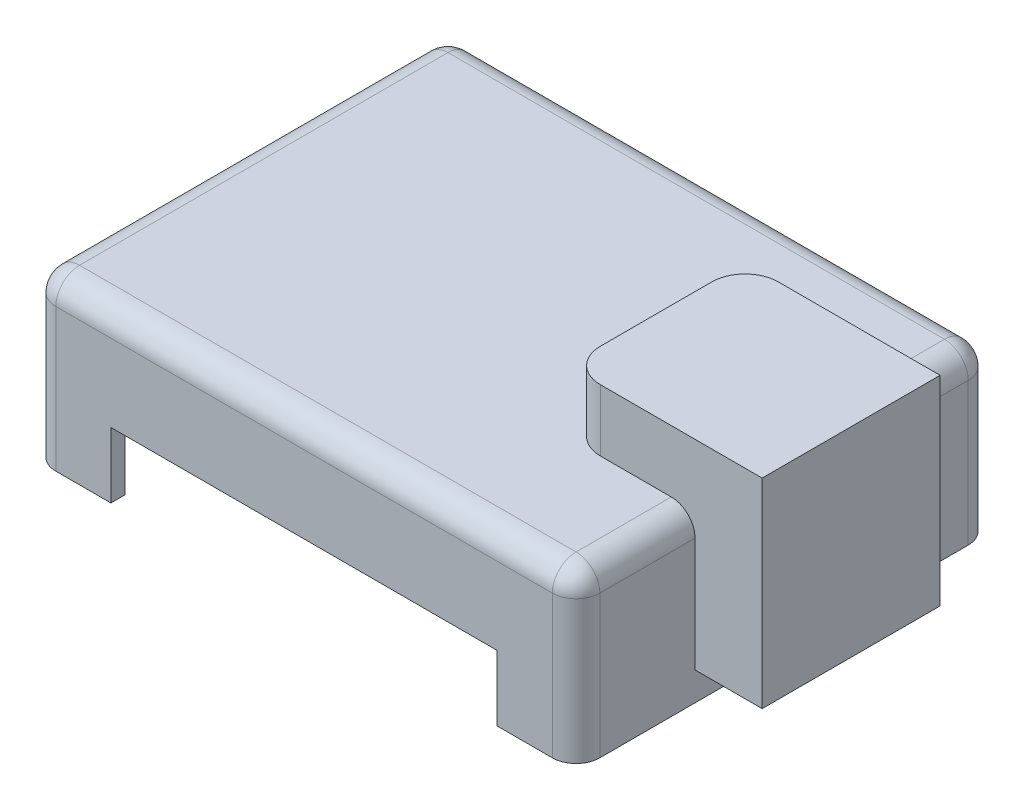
ISO-10303-21;
HEADER;
FILE_DESCRIPTION(('STEP AP214'),'2;1');
FILE_NAME('part.step','',(''),(''),'','','');
FILE_SCHEMA(('AUTOMOTIVE_DESIGN { 1 0 10303 214 1 1 1 1 }'));
ENDSEC;
DATA;
#1=APPLICATION_CONTEXT('core data for automotive mechanical design processes');
#2=APPLICATION_PROTOCOL_DEFINITION('international standard','automotive_design',2000,#1);
#3=PRODUCT_CONTEXT('',#1,'mechanical');
#4=PRODUCT('Part','Part','',(#3));
#5=PRODUCT_RELATED_PRODUCT_CATEGORY('part','',(#4));
#6=PRODUCT_DEFINITION_FORMATION('','',#4);
#7=PRODUCT_DEFINITION_CONTEXT('part definition',#1,'design');
#8=PRODUCT_DEFINITION('design','',#6,#7);
#9=PRODUCT_DEFINITION_SHAPE('','',#8);
#10=(LENGTH_UNIT() NAMED_UNIT(*) SI_UNIT(.MILLI.,.METRE.));
#11=(NAMED_UNIT(*) PLANE_ANGLE_UNIT() SI_UNIT($,.RADIAN.));
#12=(NAMED_UNIT(*) SI_UNIT($,.STERADIAN.) SOLID_ANGLE_UNIT());
#13=UNCERTAINTY_MEASURE_WITH_UNIT(LENGTH_MEASURE(1.E-05),#10,'distance_accuracy_value','');
#14=(GEOMETRIC_REPRESENTATION_CONTEXT(3) GLOBAL_UNCERTAINTY_ASSIGNED_CONTEXT((#13)) GLOBAL_UNIT_ASSIGNED_CONTEXT((#10,
#11,#12)) REPRESENTATION_CONTEXT('',''));
#15=CARTESIAN_POINT('',(0.,0.,0.));
#16=DIRECTION('',(0.,0.,1.));
#17=DIRECTION('',(1.,0.,0.));
#18=AXIS2_PLACEMENT_3D('',#15,#16,#17);
#19=CARTESIAN_POINT('',(71.3184047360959,48.,-18.7130463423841));
#20=DIRECTION('',(-1.,0.,0.));
#21=DIRECTION('',(0.,0.,1.));
#22=AXIS2_PLACEMENT_3D('',#19,#20,#21);
#23=PLANE('',#22);
#24=DIRECTION('',(0.,-1.,0.));
#25=VECTOR('',#24,1.);
#26=CARTESIAN_POINT('',(71.3184047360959,48.,18.7130463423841));
#27=LINE('',#26,#25);
#28=CARTESIAN_POINT('',(71.3184047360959,48.,18.7130463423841));
#29=VERTEX_POINT('',#28);
#30=CARTESIAN_POINT('',(71.3184047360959,6.00000000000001,18.7130463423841));
#31=VERTEX_POINT('',#30);
#32=EDGE_CURVE('E106',#29,#31,#27,.T.);
#33=ORIENTED_EDGE('',*,*,#32,.T.);
#34=DIRECTION('',(0.,0.,-1.));
#35=VECTOR('',#34,1.);
#36=CARTESIAN_POINT('',(71.3184047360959,6.00000000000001,-18.7130463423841));
#37=LINE('',#36,#35);
#38=CARTESIAN_POINT('',(71.3184047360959,6.00000000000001,-18.7130463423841));
#39=VERTEX_POINT('',#38);
#40=EDGE_CURVE('E100',#31,#39,#37,.T.);
#41=ORIENTED_EDGE('',*,*,#40,.T.);
#42=DIRECTION('',(0.,-1.,0.));
#43=VECTOR('',#42,1.);
#44=CARTESIAN_POINT('',(71.3184047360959,48.,-18.7130463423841));
#45=LINE('',#44,#43);
#46=CARTESIAN_POINT('',(71.3184047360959,48.,-18.7130463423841));
#47=VERTEX_POINT('',#46);
#48=EDGE_CURVE('E12',#47,#39,#45,.T.);
#49=ORIENTED_EDGE('',*,*,#48,.F.);
#50=DIRECTION('',(0.,0.,-1.));
#51=VECTOR('',#50,1.);
#52=CARTESIAN_POINT('',(71.3184047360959,48.,-18.7130463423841));
#53=LINE('',#52,#51);
#54=EDGE_CURVE('E118',#29,#47,#53,.T.);
#55=ORIENTED_EDGE('',*,*,#54,.F.);
#56=EDGE_LOOP('',(#33,#41,#49,#55));
#57=FACE_BOUND('',#56,.T.);
#58=ADVANCED_FACE('F36',(#57),#23,.F.);
#59=CARTESIAN_POINT('',(37.3006394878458,48.,-18.7130463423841));
#60=DIRECTION('',(0.,0.,1.));
#61=DIRECTION('',(1.,0.,0.));
#62=AXIS2_PLACEMENT_3D('',#59,#60,#61);
#63=PLANE('',#62);
#64=ORIENTED_EDGE('',*,*,#48,.T.);
#65=DIRECTION('',(-1.,0.,0.));
#66=VECTOR('',#65,1.);
#67=CARTESIAN_POINT('',(37.3006394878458,6.00000000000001,-18.7130463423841));
#68=LINE('',#67,#66);
#69=CARTESIAN_POINT('',(37.3006394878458,6.00000000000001,-18.7130463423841));
#70=VERTEX_POINT('',#69);
#71=EDGE_CURVE('E90',#39,#70,#68,.T.);
#72=ORIENTED_EDGE('',*,*,#71,.T.);
#73=DIRECTION('',(0.,-1.,0.));
#74=VECTOR('',#73,1.);
#75=CARTESIAN_POINT('',(37.3006394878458,48.,-18.7130463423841));
#76=LINE('',#75,#74);
#77=CARTESIAN_POINT('',(37.3006394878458,48.,-18.7130463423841));
#78=VERTEX_POINT('',#77);
#79=EDGE_CURVE('E43',#78,#70,#76,.T.);
#80=ORIENTED_EDGE('',*,*,#79,.F.);
#81=DIRECTION('',(-1.,0.,0.));
#82=VECTOR('',#81,1.);
#83=CARTESIAN_POINT('',(37.3006394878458,48.,-18.7130463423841));
#84=LINE('',#83,#82);
#85=EDGE_CURVE('E91',#47,#78,#84,.T.);
#86=ORIENTED_EDGE('',*,*,#85,.F.);
#87=EDGE_LOOP('',(#64,#72,#80,#86));
#88=FACE_BOUND('',#87,.T.);
#89=ADVANCED_FACE('F88',(#88),#63,.F.);
#90=CARTESIAN_POINT('',(37.3006394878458,48.,-11.7130463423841));
#91=DIRECTION('',(0.,-1.,0.));
#92=DIRECTION('',(0.,0.,-1.));
#93=AXIS2_PLACEMENT_3D('',#90,#91,#92);
#94=CYLINDRICAL_SURFACE('',#93,7.);
#95=ORIENTED_EDGE('',*,*,#79,.T.);
#96=CARTESIAN_POINT('',(37.3006394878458,6.00000000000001,-11.7130463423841));
#97=DIRECTION('',(0.,1.,0.));
#98=DIRECTION('',(0.,0.,1.));
#99=AXIS2_PLACEMENT_3D('',#96,#97,#98);
#100=CIRCLE('',#99,7.);
#101=CARTESIAN_POINT('',(30.3006394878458,6.00000000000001,-11.7130463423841));
#102=VERTEX_POINT('',#101);
#103=EDGE_CURVE('E104',#70,#102,#100,.T.);
#104=ORIENTED_EDGE('',*,*,#103,.T.);
#105=DIRECTION('',(0.,-1.,0.));
#106=VECTOR('',#105,1.);
#107=CARTESIAN_POINT('',(30.3006394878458,48.,-11.7130463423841));
#108=LINE('',#107,#106);
#109=CARTESIAN_POINT('',(30.3006394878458,48.,-11.7130463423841));
#110=VERTEX_POINT('',#109);
#111=EDGE_CURVE('E132',#110,#102,#108,.T.);
#112=ORIENTED_EDGE('',*,*,#111,.F.);
#113=CARTESIAN_POINT('',(37.3006394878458,48.,-11.7130463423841));
#114=DIRECTION('',(0.,1.,0.));
#115=DIRECTION('',(0.,0.,1.));
#116=AXIS2_PLACEMENT_3D('',#113,#114,#115);
#117=CIRCLE('',#116,7.);
#118=EDGE_CURVE('E121',#78,#110,#117,.T.);
#119=ORIENTED_EDGE('',*,*,#118,.F.);
#120=EDGE_LOOP('',(#95,#104,#112,#119));
#121=FACE_BOUND('',#120,.T.);
#122=ADVANCED_FACE('F135',(#121),#94,.T.);
#123=CARTESIAN_POINT('',(30.3006394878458,48.,-11.7130463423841));
#124=DIRECTION('',(1.,0.,0.));
#125=DIRECTION('',(0.,0.,-1.));
#126=AXIS2_PLACEMENT_3D('',#123,#124,#125);
#127=PLANE('',#126);
#128=ORIENTED_EDGE('',*,*,#111,.T.);
#129=DIRECTION('',(0.,0.,1.));
#130=VECTOR('',#129,1.);
#131=CARTESIAN_POINT('',(30.3006394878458,6.00000000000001,-11.7130463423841));
#132=LINE('',#131,#130);
#133=CARTESIAN_POINT('',(30.3006394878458,6.00000000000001,11.7130463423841));
#134=VERTEX_POINT('',#133);
#135=EDGE_CURVE('E110',#102,#134,#132,.T.);
#136=ORIENTED_EDGE('',*,*,#135,.T.);
#137=DIRECTION('',(0.,-1.,0.));
#138=VECTOR('',#137,1.);
#139=CARTESIAN_POINT('',(30.3006394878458,48.,11.7130463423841));
#140=LINE('',#139,#138);
#141=CARTESIAN_POINT('',(30.3006394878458,48.,11.7130463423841));
#142=VERTEX_POINT('',#141);
#143=EDGE_CURVE('E130',#142,#134,#140,.T.);
#144=ORIENTED_EDGE('',*,*,#143,.F.);
#145=DIRECTION('',(0.,0.,1.));
#146=VECTOR('',#145,1.);
#147=CARTESIAN_POINT('',(30.3006394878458,48.,-11.7130463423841));
#148=LINE('',#147,#146);
#149=EDGE_CURVE('E123',#110,#142,#148,.T.);
#150=ORIENTED_EDGE('',*,*,#149,.F.);
#151=EDGE_LOOP('',(#128,#136,#144,#150));
#152=FACE_BOUND('',#151,.T.);
#153=ADVANCED_FACE('F141',(#152),#127,.F.);
#154=CARTESIAN_POINT('',(37.3006394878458,48.,11.7130463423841));
#155=DIRECTION('',(0.,-1.,0.));
#156=DIRECTION('',(0.,0.,-1.));
#157=AXIS2_PLACEMENT_3D('',#154,#155,#156);
#158=CYLINDRICAL_SURFACE('',#157,7.);
#159=ORIENTED_EDGE('',*,*,#143,.T.);
#160=CARTESIAN_POINT('',(37.3006394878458,6.00000000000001,11.7130463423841));
#161=DIRECTION('',(0.,1.,0.));
#162=DIRECTION('',(0.,0.,1.));
#163=AXIS2_PLACEMENT_3D('',#160,#161,#162);
#164=CIRCLE('',#163,7.);
#165=CARTESIAN_POINT('',(37.3006394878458,6.00000000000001,18.7130463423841));
#166=VERTEX_POINT('',#165);
#167=EDGE_CURVE('E113',#134,#166,#164,.T.);
#168=ORIENTED_EDGE('',*,*,#167,.T.);
#169=DIRECTION('',(0.,-1.,0.));
#170=VECTOR('',#169,1.);
#171=CARTESIAN_POINT('',(37.3006394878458,48.,18.7130463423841));
#172=LINE('',#171,#170);
#173=CARTESIAN_POINT('',(37.3006394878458,48.,18.7130463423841));
#174=VERTEX_POINT('',#173);
#175=EDGE_CURVE('E128',#174,#166,#172,.T.);
#176=ORIENTED_EDGE('',*,*,#175,.F.);
#177=CARTESIAN_POINT('',(37.3006394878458,48.,11.7130463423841));
#178=DIRECTION('',(0.,1.,0.));
#179=DIRECTION('',(0.,0.,1.));
#180=AXIS2_PLACEMENT_3D('',#177,#178,#179);
#181=CIRCLE('',#180,7.);
#182=EDGE_CURVE('E55',#142,#174,#181,.T.);
#183=ORIENTED_EDGE('',*,*,#182,.F.);
#184=EDGE_LOOP('',(#159,#168,#176,#183));
#185=FACE_BOUND('',#184,.T.);
#186=ADVANCED_FACE('F144',(#185),#158,.T.);
#187=CARTESIAN_POINT('',(37.3006394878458,48.,18.7130463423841));
#188=DIRECTION('',(0.,0.,-1.));
#189=DIRECTION('',(-1.,0.,0.));
#190=AXIS2_PLACEMENT_3D('',#187,#188,#189);
#191=PLANE('',#190);
#192=ORIENTED_EDGE('',*,*,#175,.T.);
#193=DIRECTION('',(1.,0.,0.));
#194=VECTOR('',#193,1.);
#195=CARTESIAN_POINT('',(37.3006394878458,6.00000000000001,18.7130463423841));
#196=LINE('',#195,#194);
#197=EDGE_CURVE('E116',#166,#31,#196,.T.);
#198=ORIENTED_EDGE('',*,*,#197,.T.);
#199=ORIENTED_EDGE('',*,*,#32,.F.);
#200=DIRECTION('',(1.,0.,0.));
#201=VECTOR('',#200,1.);
#202=CARTESIAN_POINT('',(37.3006394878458,48.,18.7130463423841));
#203=LINE('',#202,#201);
#204=EDGE_CURVE('E50',#174,#29,#203,.T.);
#205=ORIENTED_EDGE('',*,*,#204,.F.);
#206=EDGE_LOOP('',(#192,#198,#199,#205));
#207=FACE_BOUND('',#206,.T.);
#208=ADVANCED_FACE('F146',(#207),#191,.F.);
#209=CARTESIAN_POINT('',(37.3006394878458,48.,11.7130463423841));
#210=DIRECTION('',(0.,1.,0.));
#211=DIRECTION('',(0.,0.,1.));
#212=AXIS2_PLACEMENT_3D('',#209,#210,#211);
#213=PLANE('',#212);
#214=ORIENTED_EDGE('',*,*,#54,.T.);
#215=ORIENTED_EDGE('',*,*,#85,.T.);
#216=ORIENTED_EDGE('',*,*,#118,.T.);
#217=ORIENTED_EDGE('',*,*,#149,.T.);
#218=ORIENTED_EDGE('',*,*,#182,.T.);
#219=ORIENTED_EDGE('',*,*,#204,.T.);
#220=EDGE_LOOP('',(#214,#215,#216,#217,#218,#219));
#221=FACE_BOUND('',#220,.T.);
#222=ADVANCED_FACE('F138',(#221),#213,.T.);
#223=CARTESIAN_POINT('',(37.3006394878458,6.00000000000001,11.7130463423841));
#224=DIRECTION('',(0.,1.,0.));
#225=DIRECTION('',(0.,0.,1.));
#226=AXIS2_PLACEMENT_3D('',#223,#224,#225);
#227=PLANE('',#226);
#228=ORIENTED_EDGE('',*,*,#40,.F.);
#229=ORIENTED_EDGE('',*,*,#197,.F.);
#230=ORIENTED_EDGE('',*,*,#167,.F.);
#231=ORIENTED_EDGE('',*,*,#135,.F.);
#232=ORIENTED_EDGE('',*,*,#103,.F.);
#233=ORIENTED_EDGE('',*,*,#71,.F.);
#234=EDGE_LOOP('',(#228,#229,#230,#231,#232,#233));
#235=FACE_BOUND('',#234,.T.);
#236=ADVANCED_FACE('F98',(#235),#227,.F.);
#237=CLOSED_SHELL('',(#58,#89,#122,#153,#186,#208,#222,#236));
#238=MANIFOLD_SOLID_BREP('B2',#237);
#239=CARTESIAN_POINT('',(-57.2074120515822,35.,-43.7327831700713));
#240=DIRECTION('',(1.,0.,0.));
#241=DIRECTION('',(0.,0.,-1.));
#242=AXIS2_PLACEMENT_3D('',#239,#240,#241);
#243=PLANE('',#242);
#244=DIRECTION('',(0.,0.,1.));
#245=VECTOR('',#244,1.);
#246=CARTESIAN_POINT('',(-57.2074120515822,30.,-43.7327831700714));
#247=LINE('',#246,#245);
#248=CARTESIAN_POINT('',(-57.2074120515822,30.,38.7327831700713));
#249=VERTEX_POINT('',#248);
#250=CARTESIAN_POINT('',(-57.2074120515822,30.,-38.7327831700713));
#251=VERTEX_POINT('',#250);
#252=EDGE_CURVE('E468',#249,#251,#247,.F.);
#253=ORIENTED_EDGE('',*,*,#252,.T.);
#254=DIRECTION('',(0.,-1.,0.));
#255=VECTOR('',#254,1.);
#256=CARTESIAN_POINT('',(-57.2074120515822,35.,-38.7327831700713));
#257=LINE('',#256,#255);
#258=CARTESIAN_POINT('',(-57.2074120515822,0.,-38.7327831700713));
#259=VERTEX_POINT('',#258);
#260=EDGE_CURVE('E470',#251,#259,#257,.T.);
#261=ORIENTED_EDGE('',*,*,#260,.T.);
#262=DIRECTION('',(0.,0.,1.));
#263=VECTOR('',#262,1.);
#264=CARTESIAN_POINT('',(-57.2074120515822,0.,-43.7327831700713));
#265=LINE('',#264,#263);
#266=CARTESIAN_POINT('',(-57.2074120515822,0.,38.7327831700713));
#267=VERTEX_POINT('',#266);
#268=EDGE_CURVE('E426',#259,#267,#265,.T.);
#269=ORIENTED_EDGE('',*,*,#268,.T.);
#270=DIRECTION('',(0.,-1.,0.));
#271=VECTOR('',#270,1.);
#272=CARTESIAN_POINT('',(-57.2074120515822,35.,38.7327831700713));
#273=LINE('',#272,#271);
#274=EDGE_CURVE('E466',#267,#249,#273,.F.);
#275=ORIENTED_EDGE('',*,*,#274,.T.);
#276=EDGE_LOOP('',(#253,#261,#269,#275));
#277=FACE_BOUND('',#276,.T.);
#278=ADVANCED_FACE('F196',(#277),#243,.F.);
#279=CARTESIAN_POINT('',(-57.2074120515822,35.,43.7327831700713));
#280=DIRECTION('',(0.,0.,-1.));
#281=DIRECTION('',(-1.,0.,0.));
#282=AXIS2_PLACEMENT_3D('',#279,#280,#281);
#283=PLANE('',#282);
#284=DIRECTION('',(1.,0.,0.));
#285=VECTOR('',#284,1.);
#286=CARTESIAN_POINT('',(-57.2074120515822,0.,43.7327831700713));
#287=LINE('',#286,#285);
#288=CARTESIAN_POINT('',(-52.2074120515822,0.,43.7327831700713));
#289=VERTEX_POINT('',#288);
#290=CARTESIAN_POINT('',(-40.6196419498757,0.,43.7327831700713));
#291=VERTEX_POINT('',#290);
#292=EDGE_CURVE('E429',#289,#291,#287,.T.);
#293=ORIENTED_EDGE('',*,*,#292,.T.);
#294=DIRECTION('',(0.,-1.,0.));
#295=VECTOR('',#294,1.);
#296=CARTESIAN_POINT('',(-40.6196419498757,0.,43.7327831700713));
#297=LINE('',#296,#295);
#298=CARTESIAN_POINT('',(-40.6196419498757,13.7609534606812,43.7327831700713));
#299=VERTEX_POINT('',#298);
#300=EDGE_CURVE('E372',#299,#291,#297,.T.);
#301=ORIENTED_EDGE('',*,*,#300,.F.);
#302=DIRECTION('',(-1.,0.,0.));
#303=VECTOR('',#302,1.);
#304=CARTESIAN_POINT('',(-40.6196419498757,13.7609534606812,43.7327831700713));
#305=LINE('',#304,#303);
#306=CARTESIAN_POINT('',(40.6196419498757,13.7609534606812,43.7327831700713));
#307=VERTEX_POINT('',#306);
#308=EDGE_CURVE('E858',#307,#299,#305,.T.);
#309=ORIENTED_EDGE('',*,*,#308,.F.);
#310=DIRECTION('',(0.,1.,0.));
#311=VECTOR('',#310,1.);
#312=CARTESIAN_POINT('',(40.6196419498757,0.,43.7327831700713));
#313=LINE('',#312,#311);
#314=CARTESIAN_POINT('',(40.6196419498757,0.,43.7327831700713));
#315=VERTEX_POINT('',#314);
#316=EDGE_CURVE('E913',#315,#307,#313,.T.);
#317=ORIENTED_EDGE('',*,*,#316,.F.);
#318=CARTESIAN_POINT('',(52.2074120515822,0.,43.7327831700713));
#319=VERTEX_POINT('',#318);
#320=EDGE_CURVE('E371',#315,#319,#287,.T.);
#321=ORIENTED_EDGE('',*,*,#320,.T.);
#322=DIRECTION('',(0.,-1.,0.));
#323=VECTOR('',#322,1.);
#324=CARTESIAN_POINT('',(52.2074120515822,35.,43.7327831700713));
#325=LINE('',#324,#323);
#326=CARTESIAN_POINT('',(52.2074120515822,30.,43.7327831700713));
#327=VERTEX_POINT('',#326);
#328=EDGE_CURVE('E464',#319,#327,#325,.F.);
#329=ORIENTED_EDGE('',*,*,#328,.T.);
#330=DIRECTION('',(1.,0.,0.));
#331=VECTOR('',#330,1.);
#332=CARTESIAN_POINT('',(-57.2074120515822,30.,43.7327831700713));
#333=LINE('',#332,#331);
#334=CARTESIAN_POINT('',(-52.2074120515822,30.,43.7327831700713));
#335=VERTEX_POINT('',#334);
#336=EDGE_CURVE('E462',#327,#335,#333,.F.);
#337=ORIENTED_EDGE('',*,*,#336,.T.);
#338=DIRECTION('',(0.,-1.,0.));
#339=VECTOR('',#338,1.);
#340=CARTESIAN_POINT('',(-52.2074120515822,35.,43.7327831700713));
#341=LINE('',#340,#339);
#342=EDGE_CURVE('E460',#335,#289,#341,.T.);
#343=ORIENTED_EDGE('',*,*,#342,.T.);
#344=EDGE_LOOP('',(#293,#301,#309,#317,#321,#329,#337,#343));
#345=FACE_BOUND('',#344,.T.);
#346=ADVANCED_FACE('F511',(#345),#283,.F.);
#347=CARTESIAN_POINT('',(57.2074120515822,35.,-43.7327831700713));
#348=DIRECTION('',(-1.,0.,0.));
#349=DIRECTION('',(0.,0.,1.));
#350=AXIS2_PLACEMENT_3D('',#347,#348,#349);
#351=PLANE('',#350);
#352=DIRECTION('',(0.,0.,-1.));
#353=VECTOR('',#352,1.);
#354=CARTESIAN_POINT('',(57.2074120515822,0.,-43.7327831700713));
#355=LINE('',#354,#353);
#356=CARTESIAN_POINT('',(57.2074120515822,0.,38.7327831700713));
#357=VERTEX_POINT('',#356);
#358=CARTESIAN_POINT('',(57.2074120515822,0.,-38.7327831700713));
#359=VERTEX_POINT('',#358);
#360=EDGE_CURVE('E432',#357,#359,#355,.T.);
#361=ORIENTED_EDGE('',*,*,#360,.T.);
#362=DIRECTION('',(0.,-1.,0.));
#363=VECTOR('',#362,1.);
#364=CARTESIAN_POINT('',(57.2074120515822,35.,-38.7327831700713));
#365=LINE('',#364,#363);
#366=CARTESIAN_POINT('',(57.2074120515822,30.,-38.7327831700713));
#367=VERTEX_POINT('',#366);
#368=EDGE_CURVE('E458',#359,#367,#365,.F.);
#369=ORIENTED_EDGE('',*,*,#368,.T.);
#370=DIRECTION('',(0.,0.,-1.));
#371=VECTOR('',#370,1.);
#372=CARTESIAN_POINT('',(57.2074120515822,30.,43.7327831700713));
#373=LINE('',#372,#371);
#374=CARTESIAN_POINT('',(57.2074120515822,30.,38.7327831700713));
#375=VERTEX_POINT('',#374);
#376=EDGE_CURVE('E456',#367,#375,#373,.F.);
#377=ORIENTED_EDGE('',*,*,#376,.T.);
#378=DIRECTION('',(0.,-1.,0.));
#379=VECTOR('',#378,1.);
#380=CARTESIAN_POINT('',(57.2074120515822,35.,38.7327831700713));
#381=LINE('',#380,#379);
#382=EDGE_CURVE('E454',#375,#357,#381,.T.);
#383=ORIENTED_EDGE('',*,*,#382,.T.);
#384=EDGE_LOOP('',(#361,#369,#377,#383));
#385=FACE_BOUND('',#384,.T.);
#386=ADVANCED_FACE('F483',(#385),#351,.F.);
#387=CARTESIAN_POINT('',(-57.2074120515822,35.,-43.7327831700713));
#388=DIRECTION('',(0.,0.,1.));
#389=DIRECTION('',(1.,0.,0.));
#390=AXIS2_PLACEMENT_3D('',#387,#388,#389);
#391=PLANE('',#390);
#392=DIRECTION('',(-1.,0.,0.));
#393=VECTOR('',#392,1.);
#394=CARTESIAN_POINT('',(-57.2074120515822,0.,-43.7327831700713));
#395=LINE('',#394,#393);
#396=CARTESIAN_POINT('',(52.2074120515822,0.,-43.7327831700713));
#397=VERTEX_POINT('',#396);
#398=CARTESIAN_POINT('',(-52.2074120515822,0.,-43.7327831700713));
#399=VERTEX_POINT('',#398);
#400=EDGE_CURVE('E435',#397,#399,#395,.T.);
#401=ORIENTED_EDGE('',*,*,#400,.T.);
#402=DIRECTION('',(0.,-1.,0.));
#403=VECTOR('',#402,1.);
#404=CARTESIAN_POINT('',(-52.2074120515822,35.,-43.7327831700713));
#405=LINE('',#404,#403);
#406=CARTESIAN_POINT('',(-52.2074120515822,30.,-43.7327831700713));
#407=VERTEX_POINT('',#406);
#408=EDGE_CURVE('E452',#399,#407,#405,.F.);
#409=ORIENTED_EDGE('',*,*,#408,.T.);
#410=DIRECTION('',(-1.,0.,0.));
#411=VECTOR('',#410,1.);
#412=CARTESIAN_POINT('',(57.2074120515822,30.,-43.7327831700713));
#413=LINE('',#412,#411);
#414=CARTESIAN_POINT('',(52.2074120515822,30.,-43.7327831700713));
#415=VERTEX_POINT('',#414);
#416=EDGE_CURVE('E449',#407,#415,#413,.F.);
#417=ORIENTED_EDGE('',*,*,#416,.T.);
#418=DIRECTION('',(0.,-1.,0.));
#419=VECTOR('',#418,1.);
#420=CARTESIAN_POINT('',(52.2074120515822,35.,-43.7327831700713));
#421=LINE('',#420,#419);
#422=EDGE_CURVE('E447',#415,#397,#421,.T.);
#423=ORIENTED_EDGE('',*,*,#422,.T.);
#424=EDGE_LOOP('',(#401,#409,#417,#423));
#425=FACE_BOUND('',#424,.T.);
#426=ADVANCED_FACE('F540',(#425),#391,.F.);
#427=CARTESIAN_POINT('',(-57.2074120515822,35.,43.7327831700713));
#428=DIRECTION('',(0.,1.,0.));
#429=DIRECTION('',(0.,0.,1.));
#430=AXIS2_PLACEMENT_3D('',#427,#428,#429);
#431=PLANE('',#430);
#432=DIRECTION('',(0.,0.,-1.));
#433=VECTOR('',#432,1.);
#434=CARTESIAN_POINT('',(52.2074120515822,35.,-43.7327831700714));
#435=LINE('',#434,#433);
#436=CARTESIAN_POINT('',(52.2074120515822,35.,38.7327831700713));
#437=VERTEX_POINT('',#436);
#438=CARTESIAN_POINT('',(52.2074120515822,35.,-38.7327831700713));
#439=VERTEX_POINT('',#438);
#440=EDGE_CURVE('E442',#437,#439,#435,.T.);
#441=ORIENTED_EDGE('',*,*,#440,.T.);
#442=DIRECTION('',(-1.,0.,0.));
#443=VECTOR('',#442,1.);
#444=CARTESIAN_POINT('',(-57.2074120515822,35.,-38.7327831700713));
#445=LINE('',#444,#443);
#446=CARTESIAN_POINT('',(-52.2074120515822,35.,-38.7327831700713));
#447=VERTEX_POINT('',#446);
#448=EDGE_CURVE('E444',#439,#447,#445,.T.);
#449=ORIENTED_EDGE('',*,*,#448,.T.);
#450=DIRECTION('',(0.,0.,1.));
#451=VECTOR('',#450,1.);
#452=CARTESIAN_POINT('',(-52.2074120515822,35.,43.7327831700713));
#453=LINE('',#452,#451);
#454=CARTESIAN_POINT('',(-52.2074120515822,35.,38.7327831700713));
#455=VERTEX_POINT('',#454);
#456=EDGE_CURVE('E438',#447,#455,#453,.T.);
#457=ORIENTED_EDGE('',*,*,#456,.T.);
#458=DIRECTION('',(1.,0.,0.));
#459=VECTOR('',#458,1.);
#460=CARTESIAN_POINT('',(57.2074120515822,35.,38.7327831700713));
#461=LINE('',#460,#459);
#462=EDGE_CURVE('E440',#455,#437,#461,.T.);
#463=ORIENTED_EDGE('',*,*,#462,.T.);
#464=EDGE_LOOP('',(#441,#449,#457,#463));
#465=FACE_BOUND('',#464,.T.);
#466=ADVANCED_FACE('F542',(#465),#431,.T.);
#467=CARTESIAN_POINT('',(-57.2074120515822,0.,43.7327831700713));
#468=DIRECTION('',(0.,1.,0.));
#469=DIRECTION('',(0.,0.,1.));
#470=AXIS2_PLACEMENT_3D('',#467,#468,#469);
#471=PLANE('',#470);
#472=DIRECTION('',(1.,0.,0.));
#473=VECTOR('',#472,1.);
#474=CARTESIAN_POINT('',(-57.2074120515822,0.,40.7327831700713));
#475=LINE('',#474,#473);
#476=CARTESIAN_POINT('',(-52.2074120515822,0.,40.7327831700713));
#477=VERTEX_POINT('',#476);
#478=CARTESIAN_POINT('',(-40.6196419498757,0.,40.7327831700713));
#479=VERTEX_POINT('',#478);
#480=EDGE_CURVE('E218',#477,#479,#475,.T.);
#481=ORIENTED_EDGE('',*,*,#480,.T.);
#482=DIRECTION('',(0.,0.,1.));
#483=VECTOR('',#482,1.);
#484=CARTESIAN_POINT('',(-40.6196419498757,0.,-43.7337831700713));
#485=LINE('',#484,#483);
#486=EDGE_CURVE('E904',#479,#291,#485,.T.);
#487=ORIENTED_EDGE('',*,*,#486,.T.);
#488=ORIENTED_EDGE('',*,*,#292,.F.);
#489=CARTESIAN_POINT('',(-52.2074120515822,0.,38.7327831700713));
#490=DIRECTION('',(0.,1.,0.));
#491=DIRECTION('',(0.,0.,1.));
#492=AXIS2_PLACEMENT_3D('',#489,#490,#491);
#493=CIRCLE('',#492,5.);
#494=EDGE_CURVE('E472',#289,#267,#493,.F.);
#495=ORIENTED_EDGE('',*,*,#494,.T.);
#496=ORIENTED_EDGE('',*,*,#268,.F.);
#497=CARTESIAN_POINT('',(-52.2074120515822,0.,-38.7327831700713));
#498=DIRECTION('',(0.,1.,0.));
#499=DIRECTION('',(0.,0.,1.));
#500=AXIS2_PLACEMENT_3D('',#497,#498,#499);
#501=CIRCLE('',#500,5.);
#502=EDGE_CURVE('E34',#259,#399,#501,.F.);
#503=ORIENTED_EDGE('',*,*,#502,.T.);
#504=ORIENTED_EDGE('',*,*,#400,.F.);
#505=CARTESIAN_POINT('',(52.2074120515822,0.,-38.7327831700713));
#506=DIRECTION('',(0.,1.,0.));
#507=DIRECTION('',(0.,0.,1.));
#508=AXIS2_PLACEMENT_3D('',#505,#506,#507);
#509=CIRCLE('',#508,5.);
#510=EDGE_CURVE('E203',#397,#359,#509,.F.);
#511=ORIENTED_EDGE('',*,*,#510,.T.);
#512=ORIENTED_EDGE('',*,*,#360,.F.);
#513=CARTESIAN_POINT('',(52.2074120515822,0.,38.7327831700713));
#514=DIRECTION('',(0.,1.,0.));
#515=DIRECTION('',(0.,0.,1.));
#516=AXIS2_PLACEMENT_3D('',#513,#514,#515);
#517=CIRCLE('',#516,5.);
#518=EDGE_CURVE('E474',#357,#319,#517,.F.);
#519=ORIENTED_EDGE('',*,*,#518,.T.);
#520=ORIENTED_EDGE('',*,*,#320,.F.);
#521=DIRECTION('',(0.,0.,1.));
#522=VECTOR('',#521,1.);
#523=CARTESIAN_POINT('',(40.6196419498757,0.,-43.7337831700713));
#524=LINE('',#523,#522);
#525=CARTESIAN_POINT('',(40.6196419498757,0.,40.7327831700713));
#526=VERTEX_POINT('',#525);
#527=EDGE_CURVE('E358',#526,#315,#524,.T.);
#528=ORIENTED_EDGE('',*,*,#527,.F.);
#529=CARTESIAN_POINT('',(52.2074120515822,0.,40.7327831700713));
#530=VERTEX_POINT('',#529);
#531=EDGE_CURVE('E368',#526,#530,#475,.T.);
#532=ORIENTED_EDGE('',*,*,#531,.T.);
#533=CARTESIAN_POINT('',(52.2074120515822,0.,38.7327831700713));
#534=DIRECTION('',(0.,1.,0.));
#535=DIRECTION('',(0.,0.,1.));
#536=AXIS2_PLACEMENT_3D('',#533,#534,#535);
#537=CIRCLE('',#536,2.);
#538=CARTESIAN_POINT('',(54.2074120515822,0.,38.7327831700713));
#539=VERTEX_POINT('',#538);
#540=EDGE_CURVE('E386',#539,#530,#537,.F.);
#541=ORIENTED_EDGE('',*,*,#540,.F.);
#542=DIRECTION('',(0.,0.,-1.));
#543=VECTOR('',#542,1.);
#544=CARTESIAN_POINT('',(54.2074120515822,0.,-43.7327831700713));
#545=LINE('',#544,#543);
#546=CARTESIAN_POINT('',(54.2074120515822,0.,-38.7327831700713));
#547=VERTEX_POINT('',#546);
#548=EDGE_CURVE('E380',#539,#547,#545,.T.);
#549=ORIENTED_EDGE('',*,*,#548,.T.);
#550=CARTESIAN_POINT('',(52.2074120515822,0.,-38.7327831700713));
#551=DIRECTION('',(0.,1.,0.));
#552=DIRECTION('',(0.,0.,1.));
#553=AXIS2_PLACEMENT_3D('',#550,#551,#552);
#554=CIRCLE('',#553,2.);
#555=CARTESIAN_POINT('',(52.2074120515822,0.,-40.7327831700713));
#556=VERTEX_POINT('',#555);
#557=EDGE_CURVE('E861',#556,#547,#554,.F.);
#558=ORIENTED_EDGE('',*,*,#557,.F.);
#559=DIRECTION('',(-1.,0.,0.));
#560=VECTOR('',#559,1.);
#561=CARTESIAN_POINT('',(-57.2074120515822,0.,-40.7327831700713));
#562=LINE('',#561,#560);
#563=CARTESIAN_POINT('',(-52.2074120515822,0.,-40.7327831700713));
#564=VERTEX_POINT('',#563);
#565=EDGE_CURVE('E833',#556,#564,#562,.T.);
#566=ORIENTED_EDGE('',*,*,#565,.T.);
#567=CARTESIAN_POINT('',(-52.2074120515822,0.,-38.7327831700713));
#568=DIRECTION('',(0.,1.,0.));
#569=DIRECTION('',(0.,0.,1.));
#570=AXIS2_PLACEMENT_3D('',#567,#568,#569);
#571=CIRCLE('',#570,2.);
#572=CARTESIAN_POINT('',(-54.2074120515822,0.,-38.7327831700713));
#573=VERTEX_POINT('',#572);
#574=EDGE_CURVE('E394',#573,#564,#571,.F.);
#575=ORIENTED_EDGE('',*,*,#574,.F.);
#576=DIRECTION('',(0.,0.,1.));
#577=VECTOR('',#576,1.);
#578=CARTESIAN_POINT('',(-54.2074120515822,0.,-43.7327831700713));
#579=LINE('',#578,#577);
#580=CARTESIAN_POINT('',(-54.2074120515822,0.,38.7327831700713));
#581=VERTEX_POINT('',#580);
#582=EDGE_CURVE('E378',#573,#581,#579,.T.);
#583=ORIENTED_EDGE('',*,*,#582,.T.);
#584=CARTESIAN_POINT('',(-52.2074120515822,0.,38.7327831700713));
#585=DIRECTION('',(0.,1.,0.));
#586=DIRECTION('',(0.,0.,1.));
#587=AXIS2_PLACEMENT_3D('',#584,#585,#586);
#588=CIRCLE('',#587,2.);
#589=EDGE_CURVE('E388',#477,#581,#588,.F.);
#590=ORIENTED_EDGE('',*,*,#589,.F.);
#591=EDGE_LOOP('',(#481,#487,#488,#495,#496,#503,#504,#511,#512,#519,#520,#528,#532,#541,#549,
#558,#566,#575,#583,#590));
#592=FACE_BOUND('',#591,.T.);
#593=ADVANCED_FACE('F366',(#592),#471,.F.);
#594=CARTESIAN_POINT('',(52.2074120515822,35.,38.7327831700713));
#595=DIRECTION('',(0.,-1.,0.));
#596=DIRECTION('',(0.,0.,-1.));
#597=AXIS2_PLACEMENT_3D('',#594,#595,#596);
#598=CYLINDRICAL_SURFACE('',#597,5.);
#599=ORIENTED_EDGE('',*,*,#518,.F.);
#600=ORIENTED_EDGE('',*,*,#382,.F.);
#601=CARTESIAN_POINT('',(52.2074120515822,30.,38.7327831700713));
#602=DIRECTION('',(0.,1.,0.));
#603=DIRECTION('',(0.,0.,1.));
#604=AXIS2_PLACEMENT_3D('',#601,#602,#603);
#605=CIRCLE('',#604,5.);
#606=EDGE_CURVE('E423',#327,#375,#605,.T.);
#607=ORIENTED_EDGE('',*,*,#606,.F.);
#608=ORIENTED_EDGE('',*,*,#328,.F.);
#609=EDGE_LOOP('',(#599,#600,#607,#608));
#610=FACE_BOUND('',#609,.T.);
#611=ADVANCED_FACE('F499',(#610),#598,.T.);
#612=CARTESIAN_POINT('',(-57.2074120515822,30.,38.7327831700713));
#613=DIRECTION('',(-1.,0.,0.));
#614=DIRECTION('',(0.,0.,1.));
#615=AXIS2_PLACEMENT_3D('',#612,#613,#614);
#616=CYLINDRICAL_SURFACE('',#615,5.);
#617=CARTESIAN_POINT('',(-52.2074120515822,30.,38.7327831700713));
#618=DIRECTION('',(-1.,0.,0.));
#619=DIRECTION('',(0.,0.,1.));
#620=AXIS2_PLACEMENT_3D('',#617,#618,#619);
#621=CIRCLE('',#620,5.);
#622=EDGE_CURVE('E417',#335,#455,#621,.T.);
#623=ORIENTED_EDGE('',*,*,#622,.F.);
#624=ORIENTED_EDGE('',*,*,#336,.F.);
#625=CARTESIAN_POINT('',(52.2074120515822,30.,38.7327831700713));
#626=DIRECTION('',(1.,0.,0.));
#627=DIRECTION('',(0.,0.,-1.));
#628=AXIS2_PLACEMENT_3D('',#625,#626,#627);
#629=CIRCLE('',#628,5.);
#630=EDGE_CURVE('E420',#437,#327,#629,.T.);
#631=ORIENTED_EDGE('',*,*,#630,.F.);
#632=ORIENTED_EDGE('',*,*,#462,.F.);
#633=EDGE_LOOP('',(#623,#624,#631,#632));
#634=FACE_BOUND('',#633,.T.);
#635=ADVANCED_FACE('F508',(#634),#616,.T.);
#636=CARTESIAN_POINT('',(-52.2074120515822,35.,38.7327831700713));
#637=DIRECTION('',(0.,-1.,0.));
#638=DIRECTION('',(0.,0.,-1.));
#639=AXIS2_PLACEMENT_3D('',#636,#637,#638);
#640=CYLINDRICAL_SURFACE('',#639,5.);
#641=ORIENTED_EDGE('',*,*,#494,.F.);
#642=ORIENTED_EDGE('',*,*,#342,.F.);
#643=CARTESIAN_POINT('',(-52.2074120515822,30.,38.7327831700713));
#644=DIRECTION('',(0.,1.,0.));
#645=DIRECTION('',(0.,0.,1.));
#646=AXIS2_PLACEMENT_3D('',#643,#644,#645);
#647=CIRCLE('',#646,5.);
#648=EDGE_CURVE('E414',#249,#335,#647,.T.);
#649=ORIENTED_EDGE('',*,*,#648,.F.);
#650=ORIENTED_EDGE('',*,*,#274,.F.);
#651=EDGE_LOOP('',(#641,#642,#649,#650));
#652=FACE_BOUND('',#651,.T.);
#653=ADVANCED_FACE('F516',(#652),#640,.T.);
#654=CARTESIAN_POINT('',(52.2074120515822,30.,38.7327831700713));
#655=DIRECTION('',(0.,0.,1.));
#656=DIRECTION('',(1.,0.,0.));
#657=AXIS2_PLACEMENT_3D('',#654,#655,#656);
#658=SPHERICAL_SURFACE('',#657,5.);
#659=ORIENTED_EDGE('',*,*,#630,.T.);
#660=ORIENTED_EDGE('',*,*,#606,.T.);
#661=CARTESIAN_POINT('',(52.2074120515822,30.,38.7327831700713));
#662=DIRECTION('',(0.,0.,1.));
#663=DIRECTION('',(1.,0.,0.));
#664=AXIS2_PLACEMENT_3D('',#661,#662,#663);
#665=CIRCLE('',#664,5.);
#666=EDGE_CURVE('E411',#437,#375,#665,.F.);
#667=ORIENTED_EDGE('',*,*,#666,.F.);
#668=EDGE_LOOP('',(#659,#660,#667));
#669=FACE_BOUND('',#668,.T.);
#670=ADVANCED_FACE('F502',(#669),#658,.T.);
#671=CARTESIAN_POINT('',(-52.2074120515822,30.,38.7327831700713));
#672=DIRECTION('',(0.,0.,1.));
#673=DIRECTION('',(1.,0.,0.));
#674=AXIS2_PLACEMENT_3D('',#671,#672,#673);
#675=SPHERICAL_SURFACE('',#674,5.);
#676=ORIENTED_EDGE('',*,*,#648,.T.);
#677=ORIENTED_EDGE('',*,*,#622,.T.);
#678=CARTESIAN_POINT('',(-52.2074120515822,30.,38.7327831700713));
#679=DIRECTION('',(0.,0.,1.));
#680=DIRECTION('',(1.,0.,0.));
#681=AXIS2_PLACEMENT_3D('',#678,#679,#680);
#682=CIRCLE('',#681,5.);
#683=EDGE_CURVE('E408',#249,#455,#682,.F.);
#684=ORIENTED_EDGE('',*,*,#683,.F.);
#685=EDGE_LOOP('',(#676,#677,#684));
#686=FACE_BOUND('',#685,.T.);
#687=ADVANCED_FACE('F679',(#686),#675,.T.);
#688=CARTESIAN_POINT('',(52.2074120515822,35.,-38.7327831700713));
#689=DIRECTION('',(0.,-1.,0.));
#690=DIRECTION('',(0.,0.,-1.));
#691=AXIS2_PLACEMENT_3D('',#688,#689,#690);
#692=CYLINDRICAL_SURFACE('',#691,5.);
#693=ORIENTED_EDGE('',*,*,#510,.F.);
#694=ORIENTED_EDGE('',*,*,#422,.F.);
#695=CARTESIAN_POINT('',(52.2074120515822,30.,-38.7327831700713));
#696=DIRECTION('',(0.,1.,0.));
#697=DIRECTION('',(0.,0.,1.));
#698=AXIS2_PLACEMENT_3D('',#695,#696,#697);
#699=CIRCLE('',#698,5.);
#700=EDGE_CURVE('E405',#367,#415,#699,.T.);
#701=ORIENTED_EDGE('',*,*,#700,.F.);
#702=ORIENTED_EDGE('',*,*,#368,.F.);
#703=EDGE_LOOP('',(#693,#694,#701,#702));
#704=FACE_BOUND('',#703,.T.);
#705=ADVANCED_FACE('F487',(#704),#692,.T.);
#706=CARTESIAN_POINT('',(52.2074120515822,30.,43.7327831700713));
#707=DIRECTION('',(0.,0.,1.));
#708=DIRECTION('',(1.,0.,0.));
#709=AXIS2_PLACEMENT_3D('',#706,#707,#708);
#710=CYLINDRICAL_SURFACE('',#709,5.);
#711=ORIENTED_EDGE('',*,*,#666,.T.);
#712=ORIENTED_EDGE('',*,*,#376,.F.);
#713=CARTESIAN_POINT('',(52.2074120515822,30.,-38.7327831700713));
#714=DIRECTION('',(0.,0.,-1.));
#715=DIRECTION('',(-1.,0.,0.));
#716=AXIS2_PLACEMENT_3D('',#713,#714,#715);
#717=CIRCLE('',#716,5.);
#718=EDGE_CURVE('E402',#439,#367,#717,.T.);
#719=ORIENTED_EDGE('',*,*,#718,.F.);
#720=ORIENTED_EDGE('',*,*,#440,.F.);
#721=EDGE_LOOP('',(#711,#712,#719,#720));
#722=FACE_BOUND('',#721,.T.);
#723=ADVANCED_FACE('F495',(#722),#710,.T.);
#724=CARTESIAN_POINT('',(-52.2074120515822,30.,43.7327831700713));
#725=DIRECTION('',(0.,0.,-1.));
#726=DIRECTION('',(-1.,0.,0.));
#727=AXIS2_PLACEMENT_3D('',#724,#725,#726);
#728=CYLINDRICAL_SURFACE('',#727,5.);
#729=ORIENTED_EDGE('',*,*,#683,.T.);
#730=ORIENTED_EDGE('',*,*,#456,.F.);
#731=CARTESIAN_POINT('',(-52.2074120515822,30.,-38.7327831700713));
#732=DIRECTION('',(0.,0.,-1.));
#733=DIRECTION('',(-1.,0.,0.));
#734=AXIS2_PLACEMENT_3D('',#731,#732,#733);
#735=CIRCLE('',#734,5.);
#736=EDGE_CURVE('E399',#251,#447,#735,.T.);
#737=ORIENTED_EDGE('',*,*,#736,.F.);
#738=ORIENTED_EDGE('',*,*,#252,.F.);
#739=EDGE_LOOP('',(#729,#730,#737,#738));
#740=FACE_BOUND('',#739,.T.);
#741=ADVANCED_FACE('F533',(#740),#728,.T.);
#742=CARTESIAN_POINT('',(-52.2074120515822,35.,-38.7327831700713));
#743=DIRECTION('',(0.,-1.,0.));
#744=DIRECTION('',(0.,0.,-1.));
#745=AXIS2_PLACEMENT_3D('',#742,#743,#744);
#746=CYLINDRICAL_SURFACE('',#745,5.);
#747=ORIENTED_EDGE('',*,*,#502,.F.);
#748=ORIENTED_EDGE('',*,*,#260,.F.);
#749=CARTESIAN_POINT('',(-52.2074120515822,30.,-38.7327831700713));
#750=DIRECTION('',(0.,1.,0.));
#751=DIRECTION('',(0.,0.,1.));
#752=AXIS2_PLACEMENT_3D('',#749,#750,#751);
#753=CIRCLE('',#752,5.);
#754=EDGE_CURVE('E396',#407,#251,#753,.T.);
#755=ORIENTED_EDGE('',*,*,#754,.F.);
#756=ORIENTED_EDGE('',*,*,#408,.F.);
#757=EDGE_LOOP('',(#747,#748,#755,#756));
#758=FACE_BOUND('',#757,.T.);
#759=ADVANCED_FACE('F528',(#758),#746,.T.);
#760=CARTESIAN_POINT('',(52.2074120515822,30.,-38.7327831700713));
#761=DIRECTION('',(0.,0.,1.));
#762=DIRECTION('',(1.,0.,0.));
#763=AXIS2_PLACEMENT_3D('',#760,#761,#762);
#764=SPHERICAL_SURFACE('',#763,5.);
#765=ORIENTED_EDGE('',*,*,#718,.T.);
#766=ORIENTED_EDGE('',*,*,#700,.T.);
#767=CARTESIAN_POINT('',(52.2074120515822,30.,-38.7327831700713));
#768=DIRECTION('',(1.,0.,0.));
#769=DIRECTION('',(0.,1.,0.));
#770=AXIS2_PLACEMENT_3D('',#767,#768,#769);
#771=CIRCLE('',#770,5.);
#772=EDGE_CURVE('E393',#439,#415,#771,.F.);
#773=ORIENTED_EDGE('',*,*,#772,.F.);
#774=EDGE_LOOP('',(#765,#766,#773));
#775=FACE_BOUND('',#774,.T.);
#776=ADVANCED_FACE('F491',(#775),#764,.T.);
#777=CARTESIAN_POINT('',(-52.2074120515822,30.,-38.7327831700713));
#778=DIRECTION('',(0.,0.,1.));
#779=DIRECTION('',(1.,0.,0.));
#780=AXIS2_PLACEMENT_3D('',#777,#778,#779);
#781=SPHERICAL_SURFACE('',#780,5.);
#782=ORIENTED_EDGE('',*,*,#754,.T.);
#783=ORIENTED_EDGE('',*,*,#736,.T.);
#784=CARTESIAN_POINT('',(-52.2074120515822,30.,-38.7327831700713));
#785=DIRECTION('',(-1.,0.,0.));
#786=DIRECTION('',(0.,0.,1.));
#787=AXIS2_PLACEMENT_3D('',#784,#785,#786);
#788=CIRCLE('',#787,5.);
#789=EDGE_CURVE('E391',#407,#447,#788,.F.);
#790=ORIENTED_EDGE('',*,*,#789,.F.);
#791=EDGE_LOOP('',(#782,#783,#790));
#792=FACE_BOUND('',#791,.T.);
#793=ADVANCED_FACE('F536',(#792),#781,.T.);
#794=CARTESIAN_POINT('',(-57.2074120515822,30.,-38.7327831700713));
#795=DIRECTION('',(1.,0.,0.));
#796=DIRECTION('',(0.,0.,-1.));
#797=AXIS2_PLACEMENT_3D('',#794,#795,#796);
#798=CYLINDRICAL_SURFACE('',#797,5.);
#799=ORIENTED_EDGE('',*,*,#772,.T.);
#800=ORIENTED_EDGE('',*,*,#416,.F.);
#801=ORIENTED_EDGE('',*,*,#789,.T.);
#802=ORIENTED_EDGE('',*,*,#448,.F.);
#803=EDGE_LOOP('',(#799,#800,#801,#802));
#804=FACE_BOUND('',#803,.T.);
#805=ADVANCED_FACE('F538',(#804),#798,.T.);
#806=CARTESIAN_POINT('',(-54.2074120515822,35.,-43.7327831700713));
#807=DIRECTION('',(1.,0.,0.));
#808=DIRECTION('',(0.,0.,-1.));
#809=AXIS2_PLACEMENT_3D('',#806,#807,#808);
#810=PLANE('',#809);
#811=DIRECTION('',(0.,0.,-1.));
#812=VECTOR('',#811,1.);
#813=CARTESIAN_POINT('',(-54.2074120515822,30.,-43.7327831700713));
#814=LINE('',#813,#812);
#815=CARTESIAN_POINT('',(-54.2074120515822,30.,38.7327831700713));
#816=VERTEX_POINT('',#815);
#817=CARTESIAN_POINT('',(-54.2074120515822,30.,-38.7327831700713));
#818=VERTEX_POINT('',#817);
#819=EDGE_CURVE('E896',#816,#818,#814,.T.);
#820=ORIENTED_EDGE('',*,*,#819,.F.);
#821=DIRECTION('',(0.,1.,0.));
#822=VECTOR('',#821,1.);
#823=CARTESIAN_POINT('',(-54.2074120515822,35.,38.7327831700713));
#824=LINE('',#823,#822);
#825=EDGE_CURVE('E892',#581,#816,#824,.T.);
#826=ORIENTED_EDGE('',*,*,#825,.F.);
#827=ORIENTED_EDGE('',*,*,#582,.F.);
#828=DIRECTION('',(0.,1.,0.));
#829=VECTOR('',#828,1.);
#830=CARTESIAN_POINT('',(-54.2074120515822,35.,-38.7327831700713));
#831=LINE('',#830,#829);
#832=EDGE_CURVE('E390',#818,#573,#831,.F.);
#833=ORIENTED_EDGE('',*,*,#832,.F.);
#834=EDGE_LOOP('',(#820,#826,#827,#833));
#835=FACE_BOUND('',#834,.T.);
#836=ADVANCED_FACE('F578',(#835),#810,.T.);
#837=CARTESIAN_POINT('',(-57.2074120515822,35.,40.7327831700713));
#838=DIRECTION('',(0.,0.,-1.));
#839=DIRECTION('',(-1.,0.,0.));
#840=AXIS2_PLACEMENT_3D('',#837,#838,#839);
#841=PLANE('',#840);
#842=DIRECTION('',(0.,-1.,0.));
#843=VECTOR('',#842,1.);
#844=CARTESIAN_POINT('',(-40.6196419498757,0.,40.7327831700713));
#845=LINE('',#844,#843);
#846=CARTESIAN_POINT('',(-40.6196419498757,13.7609534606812,40.7327831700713));
#847=VERTEX_POINT('',#846);
#848=EDGE_CURVE('E906',#847,#479,#845,.T.);
#849=ORIENTED_EDGE('',*,*,#848,.T.);
#850=ORIENTED_EDGE('',*,*,#480,.F.);
#851=DIRECTION('',(0.,1.,0.));
#852=VECTOR('',#851,1.);
#853=CARTESIAN_POINT('',(-52.2074120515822,35.,40.7327831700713));
#854=LINE('',#853,#852);
#855=CARTESIAN_POINT('',(-52.2074120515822,30.,40.7327831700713));
#856=VERTEX_POINT('',#855);
#857=EDGE_CURVE('E873',#856,#477,#854,.F.);
#858=ORIENTED_EDGE('',*,*,#857,.F.);
#859=DIRECTION('',(-1.,0.,0.));
#860=VECTOR('',#859,1.);
#861=CARTESIAN_POINT('',(-57.2074120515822,30.,40.7327831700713));
#862=LINE('',#861,#860);
#863=CARTESIAN_POINT('',(52.2074120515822,30.,40.7327831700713));
#864=VERTEX_POINT('',#863);
#865=EDGE_CURVE('E875',#864,#856,#862,.T.);
#866=ORIENTED_EDGE('',*,*,#865,.F.);
#867=DIRECTION('',(0.,1.,0.));
#868=VECTOR('',#867,1.);
#869=CARTESIAN_POINT('',(52.2074120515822,35.,40.7327831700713));
#870=LINE('',#869,#868);
#871=EDGE_CURVE('E377',#530,#864,#870,.T.);
#872=ORIENTED_EDGE('',*,*,#871,.F.);
#873=ORIENTED_EDGE('',*,*,#531,.F.);
#874=DIRECTION('',(0.,1.,0.));
#875=VECTOR('',#874,1.);
#876=CARTESIAN_POINT('',(40.6196419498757,0.,40.7327831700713));
#877=LINE('',#876,#875);
#878=CARTESIAN_POINT('',(40.6196419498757,13.7609534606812,40.7327831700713));
#879=VERTEX_POINT('',#878);
#880=EDGE_CURVE('E355',#526,#879,#877,.T.);
#881=ORIENTED_EDGE('',*,*,#880,.T.);
#882=DIRECTION('',(-1.,0.,0.));
#883=VECTOR('',#882,1.);
#884=CARTESIAN_POINT('',(-40.6196419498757,13.7609534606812,40.7327831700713));
#885=LINE('',#884,#883);
#886=EDGE_CURVE('E905',#879,#847,#885,.T.);
#887=ORIENTED_EDGE('',*,*,#886,.T.);
#888=EDGE_LOOP('',(#849,#850,#858,#866,#872,#873,#881,#887));
#889=FACE_BOUND('',#888,.T.);
#890=ADVANCED_FACE('F375',(#889),#841,.T.);
#891=CARTESIAN_POINT('',(54.2074120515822,35.,-43.7327831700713));
#892=DIRECTION('',(-1.,0.,0.));
#893=DIRECTION('',(0.,0.,1.));
#894=AXIS2_PLACEMENT_3D('',#891,#892,#893);
#895=PLANE('',#894);
#896=ORIENTED_EDGE('',*,*,#548,.F.);
#897=DIRECTION('',(0.,1.,0.));
#898=VECTOR('',#897,1.);
#899=CARTESIAN_POINT('',(54.2074120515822,35.,38.7327831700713));
#900=LINE('',#899,#898);
#901=CARTESIAN_POINT('',(54.2074120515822,30.,38.7327831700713));
#902=VERTEX_POINT('',#901);
#903=EDGE_CURVE('E853',#902,#539,#900,.F.);
#904=ORIENTED_EDGE('',*,*,#903,.F.);
#905=DIRECTION('',(0.,0.,1.));
#906=VECTOR('',#905,1.);
#907=CARTESIAN_POINT('',(54.2074120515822,30.,-43.7327831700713));
#908=LINE('',#907,#906);
#909=CARTESIAN_POINT('',(54.2074120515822,30.,-38.7327831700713));
#910=VERTEX_POINT('',#909);
#911=EDGE_CURVE('E872',#910,#902,#908,.T.);
#912=ORIENTED_EDGE('',*,*,#911,.F.);
#913=DIRECTION('',(0.,1.,0.));
#914=VECTOR('',#913,1.);
#915=CARTESIAN_POINT('',(54.2074120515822,35.,-38.7327831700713));
#916=LINE('',#915,#914);
#917=EDGE_CURVE('E871',#547,#910,#916,.T.);
#918=ORIENTED_EDGE('',*,*,#917,.F.);
#919=EDGE_LOOP('',(#896,#904,#912,#918));
#920=FACE_BOUND('',#919,.T.);
#921=ADVANCED_FACE('F577',(#920),#895,.T.);
#922=CARTESIAN_POINT('',(-57.2074120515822,35.,-40.7327831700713));
#923=DIRECTION('',(0.,0.,1.));
#924=DIRECTION('',(1.,0.,0.));
#925=AXIS2_PLACEMENT_3D('',#922,#923,#924);
#926=PLANE('',#925);
#927=ORIENTED_EDGE('',*,*,#565,.F.);
#928=DIRECTION('',(0.,1.,0.));
#929=VECTOR('',#928,1.);
#930=CARTESIAN_POINT('',(52.2074120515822,35.,-40.7327831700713));
#931=LINE('',#930,#929);
#932=CARTESIAN_POINT('',(52.2074120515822,30.,-40.7327831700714));
#933=VERTEX_POINT('',#932);
#934=EDGE_CURVE('E825',#933,#556,#931,.F.);
#935=ORIENTED_EDGE('',*,*,#934,.F.);
#936=DIRECTION('',(1.,0.,0.));
#937=VECTOR('',#936,1.);
#938=CARTESIAN_POINT('',(-57.2074120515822,30.,-40.7327831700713));
#939=LINE('',#938,#937);
#940=CARTESIAN_POINT('',(-52.2074120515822,30.,-40.7327831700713));
#941=VERTEX_POINT('',#940);
#942=EDGE_CURVE('E813',#941,#933,#939,.T.);
#943=ORIENTED_EDGE('',*,*,#942,.F.);
#944=DIRECTION('',(0.,1.,0.));
#945=VECTOR('',#944,1.);
#946=CARTESIAN_POINT('',(-52.2074120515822,35.,-40.7327831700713));
#947=LINE('',#946,#945);
#948=EDGE_CURVE('E851',#564,#941,#947,.T.);
#949=ORIENTED_EDGE('',*,*,#948,.F.);
#950=EDGE_LOOP('',(#927,#935,#943,#949));
#951=FACE_BOUND('',#950,.T.);
#952=ADVANCED_FACE('F611',(#951),#926,.T.);
#953=CARTESIAN_POINT('',(-57.2074120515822,32.,43.7327831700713));
#954=DIRECTION('',(0.,1.,0.));
#955=DIRECTION('',(0.,0.,1.));
#956=AXIS2_PLACEMENT_3D('',#953,#954,#955);
#957=PLANE('',#956);
#958=DIRECTION('',(0.,0.,1.));
#959=VECTOR('',#958,1.);
#960=CARTESIAN_POINT('',(52.2074120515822,32.,43.7327831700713));
#961=LINE('',#960,#959);
#962=CARTESIAN_POINT('',(52.2074120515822,32.,38.7327831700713));
#963=VERTEX_POINT('',#962);
#964=CARTESIAN_POINT('',(52.2074120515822,32.,-38.7327831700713));
#965=VERTEX_POINT('',#964);
#966=EDGE_CURVE('E823',#963,#965,#961,.F.);
#967=ORIENTED_EDGE('',*,*,#966,.F.);
#968=DIRECTION('',(1.,0.,0.));
#969=VECTOR('',#968,1.);
#970=CARTESIAN_POINT('',(-57.2074120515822,32.,38.7327831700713));
#971=LINE('',#970,#969);
#972=CARTESIAN_POINT('',(-52.2074120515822,32.,38.7327831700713));
#973=VERTEX_POINT('',#972);
#974=EDGE_CURVE('E828',#973,#963,#971,.T.);
#975=ORIENTED_EDGE('',*,*,#974,.F.);
#976=DIRECTION('',(0.,0.,1.));
#977=VECTOR('',#976,1.);
#978=CARTESIAN_POINT('',(-52.2074120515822,32.,43.7327831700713));
#979=LINE('',#978,#977);
#980=CARTESIAN_POINT('',(-52.2074120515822,32.,-38.7327831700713));
#981=VERTEX_POINT('',#980);
#982=EDGE_CURVE('E824',#981,#973,#979,.T.);
#983=ORIENTED_EDGE('',*,*,#982,.F.);
#984=DIRECTION('',(1.,0.,0.));
#985=VECTOR('',#984,1.);
#986=CARTESIAN_POINT('',(-57.2074120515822,32.,-38.7327831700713));
#987=LINE('',#986,#985);
#988=EDGE_CURVE('E811',#965,#981,#987,.F.);
#989=ORIENTED_EDGE('',*,*,#988,.F.);
#990=EDGE_LOOP('',(#967,#975,#983,#989));
#991=FACE_BOUND('',#990,.T.);
#992=ADVANCED_FACE('F615',(#991),#957,.F.);
#993=CARTESIAN_POINT('',(52.2074120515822,35.,38.7327831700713));
#994=DIRECTION('',(0.,-1.,0.));
#995=DIRECTION('',(0.,0.,-1.));
#996=AXIS2_PLACEMENT_3D('',#993,#994,#995);
#997=CYLINDRICAL_SURFACE('',#996,2.);
#998=ORIENTED_EDGE('',*,*,#540,.T.);
#999=ORIENTED_EDGE('',*,*,#871,.T.);
#1000=CARTESIAN_POINT('',(52.2074120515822,30.,38.7327831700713));
#1001=DIRECTION('',(0.,-1.,0.));
#1002=DIRECTION('',(0.,0.,-1.));
#1003=AXIS2_PLACEMENT_3D('',#1000,#1001,#1002);
#1004=CIRCLE('',#1003,2.);
#1005=EDGE_CURVE('E382',#864,#902,#1004,.F.);
#1006=ORIENTED_EDGE('',*,*,#1005,.T.);
#1007=ORIENTED_EDGE('',*,*,#903,.T.);
#1008=EDGE_LOOP('',(#998,#999,#1006,#1007));
#1009=FACE_BOUND('',#1008,.T.);
#1010=ADVANCED_FACE('F619',(#1009),#997,.F.);
#1011=CARTESIAN_POINT('',(-57.2074120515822,30.,38.7327831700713));
#1012=DIRECTION('',(-1.,0.,0.));
#1013=DIRECTION('',(0.,0.,1.));
#1014=AXIS2_PLACEMENT_3D('',#1011,#1012,#1013);
#1015=CYLINDRICAL_SURFACE('',#1014,2.);
#1016=CARTESIAN_POINT('',(-52.2074120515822,30.,38.7327831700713));
#1017=DIRECTION('',(1.,0.,0.));
#1018=DIRECTION('',(0.,1.,0.));
#1019=AXIS2_PLACEMENT_3D('',#1016,#1017,#1018);
#1020=CIRCLE('',#1019,2.);
#1021=EDGE_CURVE('E835',#856,#973,#1020,.F.);
#1022=ORIENTED_EDGE('',*,*,#1021,.T.);
#1023=ORIENTED_EDGE('',*,*,#974,.T.);
#1024=CARTESIAN_POINT('',(52.2074120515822,30.,38.7327831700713));
#1025=DIRECTION('',(1.,0.,0.));
#1026=DIRECTION('',(0.,1.,0.));
#1027=AXIS2_PLACEMENT_3D('',#1024,#1025,#1026);
#1028=CIRCLE('',#1027,2.);
#1029=EDGE_CURVE('E838',#963,#864,#1028,.T.);
#1030=ORIENTED_EDGE('',*,*,#1029,.T.);
#1031=ORIENTED_EDGE('',*,*,#865,.T.);
#1032=EDGE_LOOP('',(#1022,#1023,#1030,#1031));
#1033=FACE_BOUND('',#1032,.T.);
#1034=ADVANCED_FACE('F623',(#1033),#1015,.F.);
#1035=CARTESIAN_POINT('',(-52.2074120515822,35.,38.7327831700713));
#1036=DIRECTION('',(0.,-1.,0.));
#1037=DIRECTION('',(0.,0.,-1.));
#1038=AXIS2_PLACEMENT_3D('',#1035,#1036,#1037);
#1039=CYLINDRICAL_SURFACE('',#1038,2.);
#1040=ORIENTED_EDGE('',*,*,#589,.T.);
#1041=ORIENTED_EDGE('',*,*,#825,.T.);
#1042=CARTESIAN_POINT('',(-52.2074120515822,30.,38.7327831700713));
#1043=DIRECTION('',(0.,1.,0.));
#1044=DIRECTION('',(-1.,0.,0.));
#1045=AXIS2_PLACEMENT_3D('',#1042,#1043,#1044);
#1046=CIRCLE('',#1045,2.);
#1047=EDGE_CURVE('E839',#816,#856,#1046,.T.);
#1048=ORIENTED_EDGE('',*,*,#1047,.T.);
#1049=ORIENTED_EDGE('',*,*,#857,.T.);
#1050=EDGE_LOOP('',(#1040,#1041,#1048,#1049));
#1051=FACE_BOUND('',#1050,.T.);
#1052=ADVANCED_FACE('F627',(#1051),#1039,.F.);
#1053=CARTESIAN_POINT('',(52.2074120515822,30.,38.7327831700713));
#1054=DIRECTION('',(0.,0.,1.));
#1055=DIRECTION('',(1.,0.,0.));
#1056=AXIS2_PLACEMENT_3D('',#1053,#1054,#1055);
#1057=SPHERICAL_SURFACE('',#1056,2.);
#1058=ORIENTED_EDGE('',*,*,#1029,.F.);
#1059=CARTESIAN_POINT('',(52.2074120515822,30.,38.7327831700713));
#1060=DIRECTION('',(0.,0.,1.));
#1061=DIRECTION('',(1.,0.,0.));
#1062=AXIS2_PLACEMENT_3D('',#1059,#1060,#1061);
#1063=CIRCLE('',#1062,2.);
#1064=EDGE_CURVE('E843',#963,#902,#1063,.F.);
#1065=ORIENTED_EDGE('',*,*,#1064,.T.);
#1066=ORIENTED_EDGE('',*,*,#1005,.F.);
#1067=EDGE_LOOP('',(#1058,#1065,#1066));
#1068=FACE_BOUND('',#1067,.T.);
#1069=ADVANCED_FACE('F631',(#1068),#1057,.F.);
#1070=CARTESIAN_POINT('',(-52.2074120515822,30.,38.7327831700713));
#1071=DIRECTION('',(0.,0.,1.));
#1072=DIRECTION('',(1.,0.,0.));
#1073=AXIS2_PLACEMENT_3D('',#1070,#1071,#1072);
#1074=SPHERICAL_SURFACE('',#1073,2.);
#1075=ORIENTED_EDGE('',*,*,#1047,.F.);
#1076=CARTESIAN_POINT('',(-52.2074120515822,30.,38.7327831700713));
#1077=DIRECTION('',(0.,0.,-1.));
#1078=DIRECTION('',(-1.,0.,0.));
#1079=AXIS2_PLACEMENT_3D('',#1076,#1077,#1078);
#1080=CIRCLE('',#1079,2.);
#1081=EDGE_CURVE('E840',#816,#973,#1080,.T.);
#1082=ORIENTED_EDGE('',*,*,#1081,.T.);
#1083=ORIENTED_EDGE('',*,*,#1021,.F.);
#1084=EDGE_LOOP('',(#1075,#1082,#1083));
#1085=FACE_BOUND('',#1084,.T.);
#1086=ADVANCED_FACE('F635',(#1085),#1074,.F.);
#1087=CARTESIAN_POINT('',(52.2074120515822,35.,-38.7327831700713));
#1088=DIRECTION('',(0.,-1.,0.));
#1089=DIRECTION('',(0.,0.,-1.));
#1090=AXIS2_PLACEMENT_3D('',#1087,#1088,#1089);
#1091=CYLINDRICAL_SURFACE('',#1090,2.);
#1092=ORIENTED_EDGE('',*,*,#557,.T.);
#1093=ORIENTED_EDGE('',*,*,#917,.T.);
#1094=CARTESIAN_POINT('',(52.2074120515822,30.,-38.7327831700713));
#1095=DIRECTION('',(0.,-1.,0.));
#1096=DIRECTION('',(0.,0.,-1.));
#1097=AXIS2_PLACEMENT_3D('',#1094,#1095,#1096);
#1098=CIRCLE('',#1097,2.);
#1099=EDGE_CURVE('E844',#910,#933,#1098,.F.);
#1100=ORIENTED_EDGE('',*,*,#1099,.T.);
#1101=ORIENTED_EDGE('',*,*,#934,.T.);
#1102=EDGE_LOOP('',(#1092,#1093,#1100,#1101));
#1103=FACE_BOUND('',#1102,.T.);
#1104=ADVANCED_FACE('F639',(#1103),#1091,.F.);
#1105=CARTESIAN_POINT('',(52.2074120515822,30.,43.7327831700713));
#1106=DIRECTION('',(0.,0.,1.));
#1107=DIRECTION('',(1.,0.,0.));
#1108=AXIS2_PLACEMENT_3D('',#1105,#1106,#1107);
#1109=CYLINDRICAL_SURFACE('',#1108,2.);
#1110=ORIENTED_EDGE('',*,*,#1064,.F.);
#1111=ORIENTED_EDGE('',*,*,#966,.T.);
#1112=CARTESIAN_POINT('',(52.2074120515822,30.,-38.7327831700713));
#1113=DIRECTION('',(0.,0.,1.));
#1114=DIRECTION('',(1.,0.,0.));
#1115=AXIS2_PLACEMENT_3D('',#1112,#1113,#1114);
#1116=CIRCLE('',#1115,2.);
#1117=EDGE_CURVE('E848',#965,#910,#1116,.F.);
#1118=ORIENTED_EDGE('',*,*,#1117,.T.);
#1119=ORIENTED_EDGE('',*,*,#911,.T.);
#1120=EDGE_LOOP('',(#1110,#1111,#1118,#1119));
#1121=FACE_BOUND('',#1120,.T.);
#1122=ADVANCED_FACE('F643',(#1121),#1109,.F.);
#1123=CARTESIAN_POINT('',(-52.2074120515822,30.,43.7327831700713));
#1124=DIRECTION('',(0.,0.,-1.));
#1125=DIRECTION('',(-1.,0.,0.));
#1126=AXIS2_PLACEMENT_3D('',#1123,#1124,#1125);
#1127=CYLINDRICAL_SURFACE('',#1126,2.);
#1128=ORIENTED_EDGE('',*,*,#1081,.F.);
#1129=ORIENTED_EDGE('',*,*,#819,.T.);
#1130=CARTESIAN_POINT('',(-52.2074120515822,30.,-38.7327831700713));
#1131=DIRECTION('',(0.,0.,1.));
#1132=DIRECTION('',(1.,0.,0.));
#1133=AXIS2_PLACEMENT_3D('',#1130,#1131,#1132);
#1134=CIRCLE('',#1133,2.);
#1135=EDGE_CURVE('E845',#818,#981,#1134,.F.);
#1136=ORIENTED_EDGE('',*,*,#1135,.T.);
#1137=ORIENTED_EDGE('',*,*,#982,.T.);
#1138=EDGE_LOOP('',(#1128,#1129,#1136,#1137));
#1139=FACE_BOUND('',#1138,.T.);
#1140=ADVANCED_FACE('F647',(#1139),#1127,.F.);
#1141=CARTESIAN_POINT('',(-52.2074120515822,35.,-38.7327831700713));
#1142=DIRECTION('',(0.,-1.,0.));
#1143=DIRECTION('',(0.,0.,-1.));
#1144=AXIS2_PLACEMENT_3D('',#1141,#1142,#1143);
#1145=CYLINDRICAL_SURFACE('',#1144,2.);
#1146=ORIENTED_EDGE('',*,*,#574,.T.);
#1147=ORIENTED_EDGE('',*,*,#948,.T.);
#1148=CARTESIAN_POINT('',(-52.2074120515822,30.,-38.7327831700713));
#1149=DIRECTION('',(0.,1.,0.));
#1150=DIRECTION('',(-1.,0.,0.));
#1151=AXIS2_PLACEMENT_3D('',#1148,#1149,#1150);
#1152=CIRCLE('',#1151,2.);
#1153=EDGE_CURVE('E817',#941,#818,#1152,.T.);
#1154=ORIENTED_EDGE('',*,*,#1153,.T.);
#1155=ORIENTED_EDGE('',*,*,#832,.T.);
#1156=EDGE_LOOP('',(#1146,#1147,#1154,#1155));
#1157=FACE_BOUND('',#1156,.T.);
#1158=ADVANCED_FACE('F651',(#1157),#1145,.F.);
#1159=CARTESIAN_POINT('',(52.2074120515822,30.,-38.7327831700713));
#1160=DIRECTION('',(0.,0.,1.));
#1161=DIRECTION('',(1.,0.,0.));
#1162=AXIS2_PLACEMENT_3D('',#1159,#1160,#1161);
#1163=SPHERICAL_SURFACE('',#1162,2.);
#1164=ORIENTED_EDGE('',*,*,#1117,.F.);
#1165=CARTESIAN_POINT('',(52.2074120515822,30.,-38.7327831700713));
#1166=DIRECTION('',(1.,0.,0.));
#1167=DIRECTION('',(0.,0.,-1.));
#1168=AXIS2_PLACEMENT_3D('',#1165,#1166,#1167);
#1169=CIRCLE('',#1168,2.);
#1170=EDGE_CURVE('E808',#965,#933,#1169,.F.);
#1171=ORIENTED_EDGE('',*,*,#1170,.T.);
#1172=ORIENTED_EDGE('',*,*,#1099,.F.);
#1173=EDGE_LOOP('',(#1164,#1171,#1172));
#1174=FACE_BOUND('',#1173,.T.);
#1175=ADVANCED_FACE('F655',(#1174),#1163,.F.);
#1176=CARTESIAN_POINT('',(-52.2074120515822,30.,-38.7327831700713));
#1177=DIRECTION('',(0.,0.,1.));
#1178=DIRECTION('',(1.,0.,0.));
#1179=AXIS2_PLACEMENT_3D('',#1176,#1177,#1178);
#1180=SPHERICAL_SURFACE('',#1179,2.);
#1181=ORIENTED_EDGE('',*,*,#1153,.F.);
#1182=CARTESIAN_POINT('',(-52.2074120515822,30.,-38.7327831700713));
#1183=DIRECTION('',(1.,0.,0.));
#1184=DIRECTION('',(0.,0.,-1.));
#1185=AXIS2_PLACEMENT_3D('',#1182,#1183,#1184);
#1186=CIRCLE('',#1185,2.);
#1187=EDGE_CURVE('E818',#941,#981,#1186,.T.);
#1188=ORIENTED_EDGE('',*,*,#1187,.T.);
#1189=ORIENTED_EDGE('',*,*,#1135,.F.);
#1190=EDGE_LOOP('',(#1181,#1188,#1189));
#1191=FACE_BOUND('',#1190,.T.);
#1192=ADVANCED_FACE('F659',(#1191),#1180,.F.);
#1193=CARTESIAN_POINT('',(-57.2074120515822,30.,-38.7327831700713));
#1194=DIRECTION('',(1.,0.,0.));
#1195=DIRECTION('',(0.,0.,-1.));
#1196=AXIS2_PLACEMENT_3D('',#1193,#1194,#1195);
#1197=CYLINDRICAL_SURFACE('',#1196,2.);
#1198=ORIENTED_EDGE('',*,*,#1170,.F.);
#1199=ORIENTED_EDGE('',*,*,#988,.T.);
#1200=ORIENTED_EDGE('',*,*,#1187,.F.);
#1201=ORIENTED_EDGE('',*,*,#942,.T.);
#1202=EDGE_LOOP('',(#1198,#1199,#1200,#1201));
#1203=FACE_BOUND('',#1202,.T.);
#1204=ADVANCED_FACE('F562',(#1203),#1197,.F.);
#1205=CARTESIAN_POINT('',(-40.6196419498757,0.,-43.7337831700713));
#1206=DIRECTION('',(-1.,0.,0.));
#1207=DIRECTION('',(0.,0.,1.));
#1208=AXIS2_PLACEMENT_3D('',#1205,#1206,#1207);
#1209=PLANE('',#1208);
#1210=DIRECTION('',(0.,0.,1.));
#1211=VECTOR('',#1210,1.);
#1212=CARTESIAN_POINT('',(-40.6196419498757,13.7609534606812,-43.7337831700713));
#1213=LINE('',#1212,#1211);
#1214=EDGE_CURVE('E362',#847,#299,#1213,.T.);
#1215=ORIENTED_EDGE('',*,*,#1214,.T.);
#1216=ORIENTED_EDGE('',*,*,#300,.T.);
#1217=ORIENTED_EDGE('',*,*,#486,.F.);
#1218=ORIENTED_EDGE('',*,*,#848,.F.);
#1219=EDGE_LOOP('',(#1215,#1216,#1217,#1218));
#1220=FACE_BOUND('',#1219,.T.);
#1221=ADVANCED_FACE('F584',(#1220),#1209,.F.);
#1222=CARTESIAN_POINT('',(-40.6196419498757,13.7609534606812,-43.7337831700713));
#1223=DIRECTION('',(0.,1.,0.));
#1224=DIRECTION('',(0.,0.,1.));
#1225=AXIS2_PLACEMENT_3D('',#1222,#1223,#1224);
#1226=PLANE('',#1225);
#1227=DIRECTION('',(0.,0.,1.));
#1228=VECTOR('',#1227,1.);
#1229=CARTESIAN_POINT('',(40.6196419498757,13.7609534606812,-43.7337831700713));
#1230=LINE('',#1229,#1228);
#1231=EDGE_CURVE('E210',#879,#307,#1230,.T.);
#1232=ORIENTED_EDGE('',*,*,#1231,.T.);
#1233=ORIENTED_EDGE('',*,*,#308,.T.);
#1234=ORIENTED_EDGE('',*,*,#1214,.F.);
#1235=ORIENTED_EDGE('',*,*,#886,.F.);
#1236=EDGE_LOOP('',(#1232,#1233,#1234,#1235));
#1237=FACE_BOUND('',#1236,.T.);
#1238=ADVANCED_FACE('F588',(#1237),#1226,.F.);
#1239=CARTESIAN_POINT('',(40.6196419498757,0.,-43.7337831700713));
#1240=DIRECTION('',(1.,0.,0.));
#1241=DIRECTION('',(0.,0.,-1.));
#1242=AXIS2_PLACEMENT_3D('',#1239,#1240,#1241);
#1243=PLANE('',#1242);
#1244=ORIENTED_EDGE('',*,*,#527,.T.);
#1245=ORIENTED_EDGE('',*,*,#316,.T.);
#1246=ORIENTED_EDGE('',*,*,#1231,.F.);
#1247=ORIENTED_EDGE('',*,*,#880,.F.);
#1248=EDGE_LOOP('',(#1244,#1245,#1246,#1247));
#1249=FACE_BOUND('',#1248,.T.);
#1250=ADVANCED_FACE('F357',(#1249),#1243,.F.);
#1251=CLOSED_SHELL('',(#278,#346,#386,#426,#466,#593,#611,#635,#653,#670,#687,#705,#723,#741,
#759,#776,#793,#805,#836,#890,#921,#952,#992,#1010,#1034,#1052,#1069,#1086,#1104,#1122,#1140,
#1158,#1175,#1192,#1204,#1221,#1238,#1250));
#1252=MANIFOLD_SOLID_BREP('B6',#1251);
#1253=ADVANCED_BREP_SHAPE_REPRESENTATION('',(#18,#238,#1252),#14);
#1254=SHAPE_DEFINITION_REPRESENTATION(#9,#1253);
ENDSEC;
END-ISO-10303-21;
